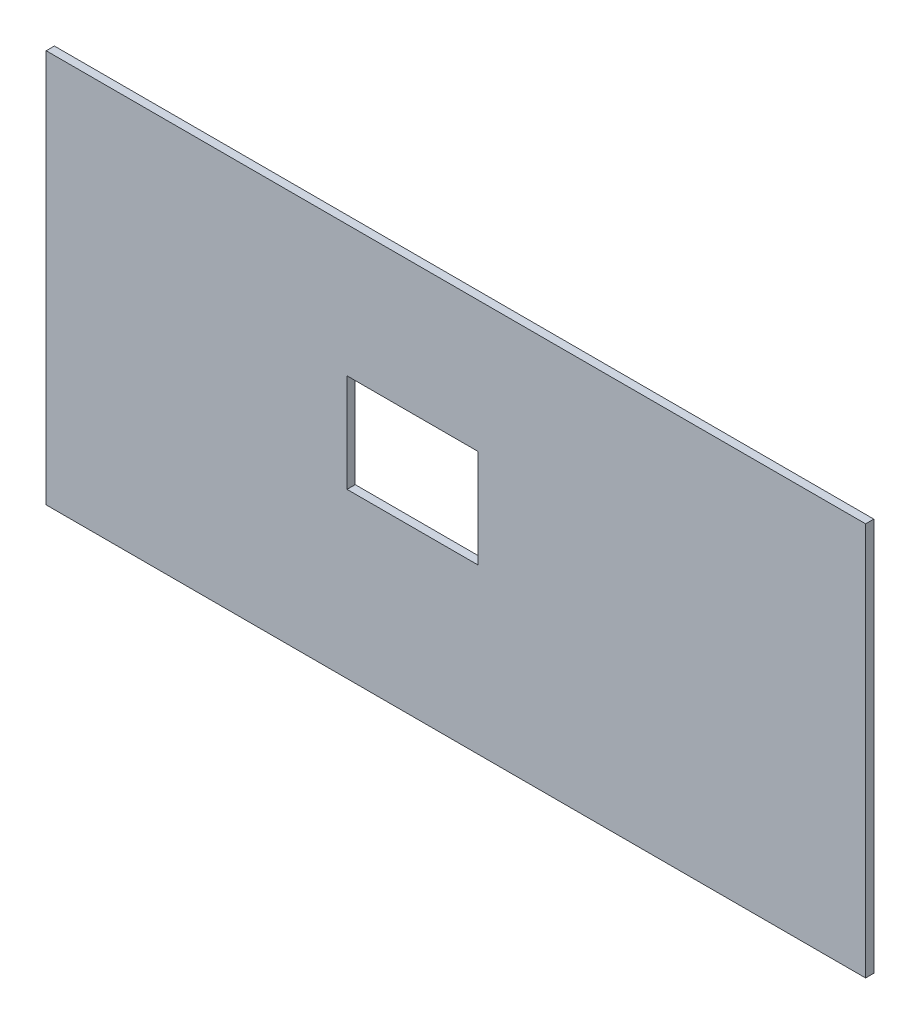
ISO-10303-21;
HEADER;
FILE_DESCRIPTION(('STEP AP214'),'2;1');
FILE_NAME('part.step','',(''),(''),'','','');
FILE_SCHEMA(('AUTOMOTIVE_DESIGN { 1 0 10303 214 1 1 1 1 }'));
ENDSEC;
DATA;
#1=APPLICATION_CONTEXT('core data for automotive mechanical design processes');
#2=APPLICATION_PROTOCOL_DEFINITION('international standard','automotive_design',2000,#1);
#3=PRODUCT_CONTEXT('',#1,'mechanical');
#4=PRODUCT('Part','Part','',(#3));
#5=PRODUCT_RELATED_PRODUCT_CATEGORY('part','',(#4));
#6=PRODUCT_DEFINITION_FORMATION('','',#4);
#7=PRODUCT_DEFINITION_CONTEXT('part definition',#1,'design');
#8=PRODUCT_DEFINITION('design','',#6,#7);
#9=PRODUCT_DEFINITION_SHAPE('','',#8);
#10=(LENGTH_UNIT() NAMED_UNIT(*) SI_UNIT(.MILLI.,.METRE.));
#11=(NAMED_UNIT(*) PLANE_ANGLE_UNIT() SI_UNIT($,.RADIAN.));
#12=(NAMED_UNIT(*) SI_UNIT($,.STERADIAN.) SOLID_ANGLE_UNIT());
#13=UNCERTAINTY_MEASURE_WITH_UNIT(LENGTH_MEASURE(1.E-05),#10,'distance_accuracy_value','');
#14=(GEOMETRIC_REPRESENTATION_CONTEXT(3) GLOBAL_UNCERTAINTY_ASSIGNED_CONTEXT((#13)) GLOBAL_UNIT_ASSIGNED_CONTEXT((#10,
#11,#12)) REPRESENTATION_CONTEXT('',''));
#15=CARTESIAN_POINT('',(0.,0.,0.));
#16=DIRECTION('',(0.,0.,1.));
#17=DIRECTION('',(1.,0.,0.));
#18=AXIS2_PLACEMENT_3D('',#15,#16,#17);
#19=CARTESIAN_POINT('',(-35.7416401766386,400.381926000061,6.35));
#20=DIRECTION('',(0.,0.,-1.));
#21=DIRECTION('',(-1.,0.,0.));
#22=AXIS2_PLACEMENT_3D('',#19,#20,#21);
#23=PLANE('',#22);
#24=DIRECTION('',(0.,-1.,0.));
#25=VECTOR('',#24,1.);
#26=CARTESIAN_POINT('',(-35.7416401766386,95.5819260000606,6.35));
#27=LINE('',#26,#25);
#28=CARTESIAN_POINT('',(-35.7416401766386,400.381926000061,6.35));
#29=VERTEX_POINT('',#28);
#30=CARTESIAN_POINT('',(-35.7416401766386,95.5819260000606,6.35));
#31=VERTEX_POINT('',#30);
#32=EDGE_CURVE('E134',#29,#31,#27,.T.);
#33=ORIENTED_EDGE('',*,*,#32,.T.);
#34=DIRECTION('',(1.,0.,0.));
#35=VECTOR('',#34,1.);
#36=CARTESIAN_POINT('',(-35.7416401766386,95.5819260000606,6.35));
#37=LINE('',#36,#35);
#38=CARTESIAN_POINT('',(599.258359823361,95.5819260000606,6.35));
#39=VERTEX_POINT('',#38);
#40=EDGE_CURVE('E137',#31,#39,#37,.T.);
#41=ORIENTED_EDGE('',*,*,#40,.T.);
#42=DIRECTION('',(0.,1.,0.));
#43=VECTOR('',#42,1.);
#44=CARTESIAN_POINT('',(599.258359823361,95.5819260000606,6.35));
#45=LINE('',#44,#43);
#46=CARTESIAN_POINT('',(599.258359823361,400.381926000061,6.35));
#47=VERTEX_POINT('',#46);
#48=EDGE_CURVE('E140',#39,#47,#45,.T.);
#49=ORIENTED_EDGE('',*,*,#48,.T.);
#50=DIRECTION('',(-1.,0.,0.));
#51=VECTOR('',#50,1.);
#52=CARTESIAN_POINT('',(-35.7416401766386,400.381926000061,6.35));
#53=LINE('',#52,#51);
#54=EDGE_CURVE('E142',#47,#29,#53,.T.);
#55=ORIENTED_EDGE('',*,*,#54,.T.);
#56=EDGE_LOOP('',(#33,#41,#49,#55));
#57=FACE_BOUND('',#56,.T.);
#58=DIRECTION('',(0.,-1.,0.));
#59=VECTOR('',#58,1.);
#60=CARTESIAN_POINT('',(197.409000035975,222.581926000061,6.35));
#61=LINE('',#60,#59);
#62=CARTESIAN_POINT('',(197.409000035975,298.781926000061,6.35));
#63=VERTEX_POINT('',#62);
#64=CARTESIAN_POINT('',(197.409000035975,222.581926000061,6.35));
#65=VERTEX_POINT('',#64);
#66=EDGE_CURVE('E98',#63,#65,#61,.T.);
#67=ORIENTED_EDGE('',*,*,#66,.F.);
#68=DIRECTION('',(-1.,0.,0.));
#69=VECTOR('',#68,1.);
#70=CARTESIAN_POINT('',(197.409000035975,298.781926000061,6.35));
#71=LINE('',#70,#69);
#72=CARTESIAN_POINT('',(299.009000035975,298.781926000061,6.35));
#73=VERTEX_POINT('',#72);
#74=EDGE_CURVE('E120',#73,#63,#71,.T.);
#75=ORIENTED_EDGE('',*,*,#74,.F.);
#76=DIRECTION('',(0.,1.,0.));
#77=VECTOR('',#76,1.);
#78=CARTESIAN_POINT('',(299.009000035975,222.581926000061,6.35));
#79=LINE('',#78,#77);
#80=CARTESIAN_POINT('',(299.009000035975,222.581926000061,6.35));
#81=VERTEX_POINT('',#80);
#82=EDGE_CURVE('E118',#81,#73,#79,.T.);
#83=ORIENTED_EDGE('',*,*,#82,.F.);
#84=DIRECTION('',(1.,0.,0.));
#85=VECTOR('',#84,1.);
#86=CARTESIAN_POINT('',(197.409000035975,222.581926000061,6.35));
#87=LINE('',#86,#85);
#88=EDGE_CURVE('E106',#65,#81,#87,.T.);
#89=ORIENTED_EDGE('',*,*,#88,.F.);
#90=EDGE_LOOP('',(#67,#75,#83,#89));
#91=FACE_BOUND('',#90,.T.);
#92=ADVANCED_FACE('F33',(#57,#91),#23,.F.);
#93=CARTESIAN_POINT('',(-35.7416401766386,400.381926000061,0.));
#94=DIRECTION('',(0.,0.,-1.));
#95=DIRECTION('',(-1.,0.,0.));
#96=AXIS2_PLACEMENT_3D('',#93,#94,#95);
#97=PLANE('',#96);
#98=DIRECTION('',(0.,-1.,0.));
#99=VECTOR('',#98,1.);
#100=CARTESIAN_POINT('',(-35.7416401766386,95.5819260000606,0.));
#101=LINE('',#100,#99);
#102=CARTESIAN_POINT('',(-35.7416401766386,400.381926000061,0.));
#103=VERTEX_POINT('',#102);
#104=CARTESIAN_POINT('',(-35.7416401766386,95.5819260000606,0.));
#105=VERTEX_POINT('',#104);
#106=EDGE_CURVE('E114',#103,#105,#101,.T.);
#107=ORIENTED_EDGE('',*,*,#106,.F.);
#108=DIRECTION('',(-1.,0.,0.));
#109=VECTOR('',#108,1.);
#110=CARTESIAN_POINT('',(-35.7416401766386,400.381926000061,0.));
#111=LINE('',#110,#109);
#112=CARTESIAN_POINT('',(599.258359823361,400.381926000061,0.));
#113=VERTEX_POINT('',#112);
#114=EDGE_CURVE('E138',#113,#103,#111,.T.);
#115=ORIENTED_EDGE('',*,*,#114,.F.);
#116=DIRECTION('',(0.,1.,0.));
#117=VECTOR('',#116,1.);
#118=CARTESIAN_POINT('',(599.258359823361,95.5819260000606,0.));
#119=LINE('',#118,#117);
#120=CARTESIAN_POINT('',(599.258359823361,95.5819260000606,0.));
#121=VERTEX_POINT('',#120);
#122=EDGE_CURVE('E149',#121,#113,#119,.T.);
#123=ORIENTED_EDGE('',*,*,#122,.F.);
#124=DIRECTION('',(1.,0.,0.));
#125=VECTOR('',#124,1.);
#126=CARTESIAN_POINT('',(-35.7416401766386,95.5819260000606,0.));
#127=LINE('',#126,#125);
#128=EDGE_CURVE('E147',#105,#121,#127,.T.);
#129=ORIENTED_EDGE('',*,*,#128,.F.);
#130=EDGE_LOOP('',(#107,#115,#123,#129));
#131=FACE_BOUND('',#130,.T.);
#132=DIRECTION('',(-1.,0.,0.));
#133=VECTOR('',#132,1.);
#134=CARTESIAN_POINT('',(197.409000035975,298.781926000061,0.));
#135=LINE('',#134,#133);
#136=CARTESIAN_POINT('',(299.009000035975,298.781926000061,0.));
#137=VERTEX_POINT('',#136);
#138=CARTESIAN_POINT('',(197.409000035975,298.781926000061,0.));
#139=VERTEX_POINT('',#138);
#140=EDGE_CURVE('E107',#137,#139,#135,.T.);
#141=ORIENTED_EDGE('',*,*,#140,.T.);
#142=DIRECTION('',(0.,-1.,0.));
#143=VECTOR('',#142,1.);
#144=CARTESIAN_POINT('',(197.409000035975,222.581926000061,0.));
#145=LINE('',#144,#143);
#146=CARTESIAN_POINT('',(197.409000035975,222.581926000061,0.));
#147=VERTEX_POINT('',#146);
#148=EDGE_CURVE('E56',#139,#147,#145,.T.);
#149=ORIENTED_EDGE('',*,*,#148,.T.);
#150=DIRECTION('',(1.,0.,0.));
#151=VECTOR('',#150,1.);
#152=CARTESIAN_POINT('',(197.409000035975,222.581926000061,0.));
#153=LINE('',#152,#151);
#154=CARTESIAN_POINT('',(299.009000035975,222.581926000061,0.));
#155=VERTEX_POINT('',#154);
#156=EDGE_CURVE('E113',#147,#155,#153,.T.);
#157=ORIENTED_EDGE('',*,*,#156,.T.);
#158=DIRECTION('',(0.,1.,0.));
#159=VECTOR('',#158,1.);
#160=CARTESIAN_POINT('',(299.009000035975,222.581926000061,0.));
#161=LINE('',#160,#159);
#162=EDGE_CURVE('E126',#155,#137,#161,.T.);
#163=ORIENTED_EDGE('',*,*,#162,.T.);
#164=EDGE_LOOP('',(#141,#149,#157,#163));
#165=FACE_BOUND('',#164,.T.);
#166=ADVANCED_FACE('F167',(#131,#165),#97,.T.);
#167=CARTESIAN_POINT('',(-35.7416401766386,95.5819260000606,6.35));
#168=DIRECTION('',(1.,0.,0.));
#169=DIRECTION('',(0.,0.,-1.));
#170=AXIS2_PLACEMENT_3D('',#167,#168,#169);
#171=PLANE('',#170);
#172=ORIENTED_EDGE('',*,*,#106,.T.);
#173=DIRECTION('',(0.,0.,-1.));
#174=VECTOR('',#173,1.);
#175=CARTESIAN_POINT('',(-35.7416401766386,95.5819260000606,6.35));
#176=LINE('',#175,#174);
#177=EDGE_CURVE('E11',#31,#105,#176,.T.);
#178=ORIENTED_EDGE('',*,*,#177,.F.);
#179=ORIENTED_EDGE('',*,*,#32,.F.);
#180=DIRECTION('',(0.,0.,-1.));
#181=VECTOR('',#180,1.);
#182=CARTESIAN_POINT('',(-35.7416401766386,400.381926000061,6.35));
#183=LINE('',#182,#181);
#184=EDGE_CURVE('E144',#29,#103,#183,.T.);
#185=ORIENTED_EDGE('',*,*,#184,.T.);
#186=EDGE_LOOP('',(#172,#178,#179,#185));
#187=FACE_BOUND('',#186,.T.);
#188=ADVANCED_FACE('F35',(#187),#171,.F.);
#189=CARTESIAN_POINT('',(-35.7416401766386,95.5819260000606,6.35));
#190=DIRECTION('',(0.,1.,0.));
#191=DIRECTION('',(0.,0.,1.));
#192=AXIS2_PLACEMENT_3D('',#189,#190,#191);
#193=PLANE('',#192);
#194=ORIENTED_EDGE('',*,*,#128,.T.);
#195=DIRECTION('',(0.,0.,-1.));
#196=VECTOR('',#195,1.);
#197=CARTESIAN_POINT('',(599.258359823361,95.5819260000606,6.35));
#198=LINE('',#197,#196);
#199=EDGE_CURVE('E41',#39,#121,#198,.T.);
#200=ORIENTED_EDGE('',*,*,#199,.F.);
#201=ORIENTED_EDGE('',*,*,#40,.F.);
#202=ORIENTED_EDGE('',*,*,#177,.T.);
#203=EDGE_LOOP('',(#194,#200,#201,#202));
#204=FACE_BOUND('',#203,.T.);
#205=ADVANCED_FACE('F177',(#204),#193,.F.);
#206=CARTESIAN_POINT('',(599.258359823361,95.5819260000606,6.35));
#207=DIRECTION('',(-1.,0.,0.));
#208=DIRECTION('',(0.,0.,1.));
#209=AXIS2_PLACEMENT_3D('',#206,#207,#208);
#210=PLANE('',#209);
#211=ORIENTED_EDGE('',*,*,#122,.T.);
#212=DIRECTION('',(0.,0.,-1.));
#213=VECTOR('',#212,1.);
#214=CARTESIAN_POINT('',(599.258359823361,400.381926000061,6.35));
#215=LINE('',#214,#213);
#216=EDGE_CURVE('E154',#47,#113,#215,.T.);
#217=ORIENTED_EDGE('',*,*,#216,.F.);
#218=ORIENTED_EDGE('',*,*,#48,.F.);
#219=ORIENTED_EDGE('',*,*,#199,.T.);
#220=EDGE_LOOP('',(#211,#217,#218,#219));
#221=FACE_BOUND('',#220,.T.);
#222=ADVANCED_FACE('F161',(#221),#210,.F.);
#223=CARTESIAN_POINT('',(-35.7416401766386,400.381926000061,6.35));
#224=DIRECTION('',(0.,-1.,0.));
#225=DIRECTION('',(0.,0.,-1.));
#226=AXIS2_PLACEMENT_3D('',#223,#224,#225);
#227=PLANE('',#226);
#228=ORIENTED_EDGE('',*,*,#114,.T.);
#229=ORIENTED_EDGE('',*,*,#184,.F.);
#230=ORIENTED_EDGE('',*,*,#54,.F.);
#231=ORIENTED_EDGE('',*,*,#216,.T.);
#232=EDGE_LOOP('',(#228,#229,#230,#231));
#233=FACE_BOUND('',#232,.T.);
#234=ADVANCED_FACE('F171',(#233),#227,.F.);
#235=CARTESIAN_POINT('',(197.409000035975,222.581926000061,6.35));
#236=DIRECTION('',(1.,0.,0.));
#237=DIRECTION('',(0.,1.,0.));
#238=AXIS2_PLACEMENT_3D('',#235,#236,#237);
#239=PLANE('',#238);
#240=ORIENTED_EDGE('',*,*,#148,.F.);
#241=DIRECTION('',(0.,0.,-1.));
#242=VECTOR('',#241,1.);
#243=CARTESIAN_POINT('',(197.409000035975,298.781926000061,6.35));
#244=LINE('',#243,#242);
#245=EDGE_CURVE('E102',#63,#139,#244,.T.);
#246=ORIENTED_EDGE('',*,*,#245,.F.);
#247=ORIENTED_EDGE('',*,*,#66,.T.);
#248=DIRECTION('',(0.,0.,-1.));
#249=VECTOR('',#248,1.);
#250=CARTESIAN_POINT('',(197.409000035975,222.581926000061,6.35));
#251=LINE('',#250,#249);
#252=EDGE_CURVE('E101',#65,#147,#251,.T.);
#253=ORIENTED_EDGE('',*,*,#252,.T.);
#254=EDGE_LOOP('',(#240,#246,#247,#253));
#255=FACE_BOUND('',#254,.T.);
#256=ADVANCED_FACE('F100',(#255),#239,.T.);
#257=CARTESIAN_POINT('',(197.409000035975,222.581926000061,6.35));
#258=DIRECTION('',(0.,1.,0.));
#259=DIRECTION('',(0.,0.,1.));
#260=AXIS2_PLACEMENT_3D('',#257,#258,#259);
#261=PLANE('',#260);
#262=ORIENTED_EDGE('',*,*,#156,.F.);
#263=ORIENTED_EDGE('',*,*,#252,.F.);
#264=ORIENTED_EDGE('',*,*,#88,.T.);
#265=DIRECTION('',(0.,0.,-1.));
#266=VECTOR('',#265,1.);
#267=CARTESIAN_POINT('',(299.009000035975,222.581926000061,6.35));
#268=LINE('',#267,#266);
#269=EDGE_CURVE('E115',#81,#155,#268,.T.);
#270=ORIENTED_EDGE('',*,*,#269,.T.);
#271=EDGE_LOOP('',(#262,#263,#264,#270));
#272=FACE_BOUND('',#271,.T.);
#273=ADVANCED_FACE('F110',(#272),#261,.T.);
#274=CARTESIAN_POINT('',(299.009000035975,222.581926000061,6.35));
#275=DIRECTION('',(-1.,0.,0.));
#276=DIRECTION('',(0.,0.,1.));
#277=AXIS2_PLACEMENT_3D('',#274,#275,#276);
#278=PLANE('',#277);
#279=ORIENTED_EDGE('',*,*,#162,.F.);
#280=ORIENTED_EDGE('',*,*,#269,.F.);
#281=ORIENTED_EDGE('',*,*,#82,.T.);
#282=DIRECTION('',(0.,0.,-1.));
#283=VECTOR('',#282,1.);
#284=CARTESIAN_POINT('',(299.009000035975,298.781926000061,6.35));
#285=LINE('',#284,#283);
#286=EDGE_CURVE('E48',#73,#137,#285,.T.);
#287=ORIENTED_EDGE('',*,*,#286,.T.);
#288=EDGE_LOOP('',(#279,#280,#281,#287));
#289=FACE_BOUND('',#288,.T.);
#290=ADVANCED_FACE('F200',(#289),#278,.T.);
#291=CARTESIAN_POINT('',(197.409000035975,298.781926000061,6.35));
#292=DIRECTION('',(0.,-1.,0.));
#293=DIRECTION('',(0.,0.,-1.));
#294=AXIS2_PLACEMENT_3D('',#291,#292,#293);
#295=PLANE('',#294);
#296=ORIENTED_EDGE('',*,*,#140,.F.);
#297=ORIENTED_EDGE('',*,*,#286,.F.);
#298=ORIENTED_EDGE('',*,*,#74,.T.);
#299=ORIENTED_EDGE('',*,*,#245,.T.);
#300=EDGE_LOOP('',(#296,#297,#298,#299));
#301=FACE_BOUND('',#300,.T.);
#302=ADVANCED_FACE('F204',(#301),#295,.T.);
#303=CLOSED_SHELL('',(#92,#166,#188,#205,#222,#234,#256,#273,#290,#302));
#304=MANIFOLD_SOLID_BREP('B2',#303);
#305=ADVANCED_BREP_SHAPE_REPRESENTATION('',(#18,#304),#14);
#306=SHAPE_DEFINITION_REPRESENTATION(#9,#305);
ENDSEC;
END-ISO-10303-21;
